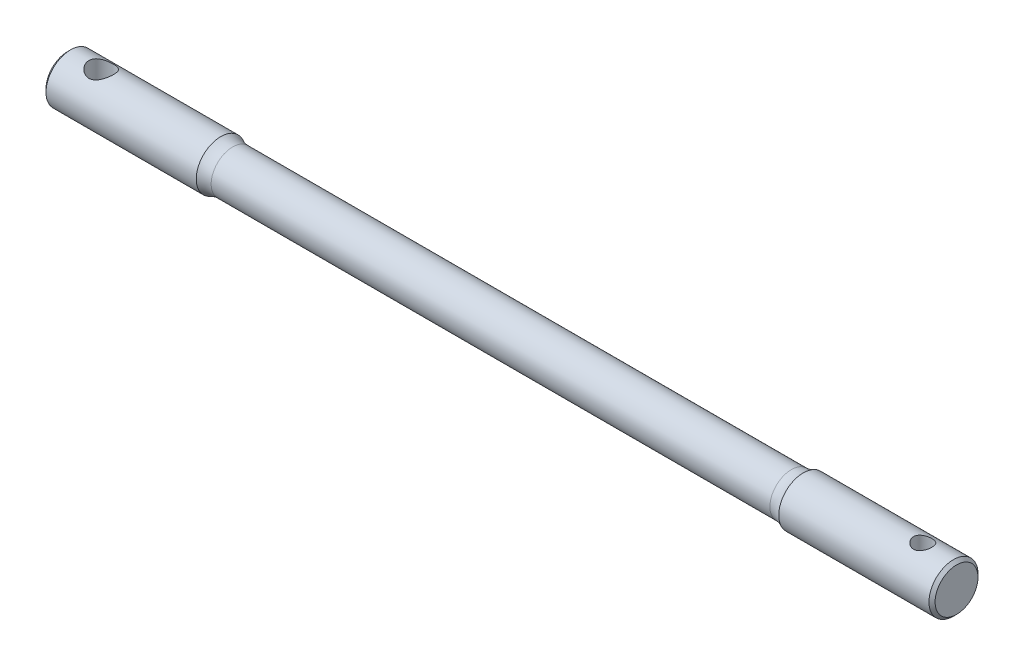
from build123d import *

# Parameters (mm, degrees)
ESQUISSE3_R             = 1.5
ESQUISSE3_R_2           = 2
ENL_V_MAT_EXTRU_2_DEPTH = 146.729200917
CHANFREIN1_SIZE         = 0.5


with BuildPart() as part:
    # Esquisse1 → Base-R_volution (revolve)
    with BuildSketch(Plane.XY, mode=Mode.PRIVATE) as base_r_volution_sk:
        with BuildLine():
            Line((0, 0), (0, 4))
            Line((0, 4), (-25, 4))
            ThreePointArc((-25, 4), (-25.936491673, 3.627016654), (-26.936491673, 3.5))
            Line((-26.936491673, 3.5), (-118.063508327, 3.5))
            ThreePointArc((-118.063508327, 3.5), (-119.063508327, 3.627016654), (-120, 4))
            Line((-120, 4), (-145, 4))
            Line((-145, 4), (-145, 0))
            Line((-145, 0), (0, 0))
        make_face()
    revolve(base_r_volution_sk.sketch.rotate(Axis((36, 0, 0), (-1, 0, 0)), 90), axis=Axis((36, 0, 0), (-1, 0, 0)))

    # Esquisse3 → Enl_v. mat.-Extru.2 (cut, through all)
    with BuildSketch(Plane(origin=(0, 10, 0), x_dir=(-1, 0, 0), z_dir=(0, 1, 0))):
        with Locations(Location((5.5, 0, 0), (0, 0, 90))):
            Circle(ESQUISSE3_R)
        with Locations(Location((139.5, 0, 0), (0, 0, 90))):
            Circle(ESQUISSE3_R_2)
    extrude(amount=-ENL_V_MAT_EXTRU_2_DEPTH, mode=Mode.SUBTRACT)

    # Chanfrein1
    chanfrein1_edges = [part.edges().sort_by_distance(p)[0] for p in [
        (0, 0, 4),
        (-145, 0, 4),
    ]]
    chamfer(chanfrein1_edges, length=CHANFREIN1_SIZE)


solid = part.part
